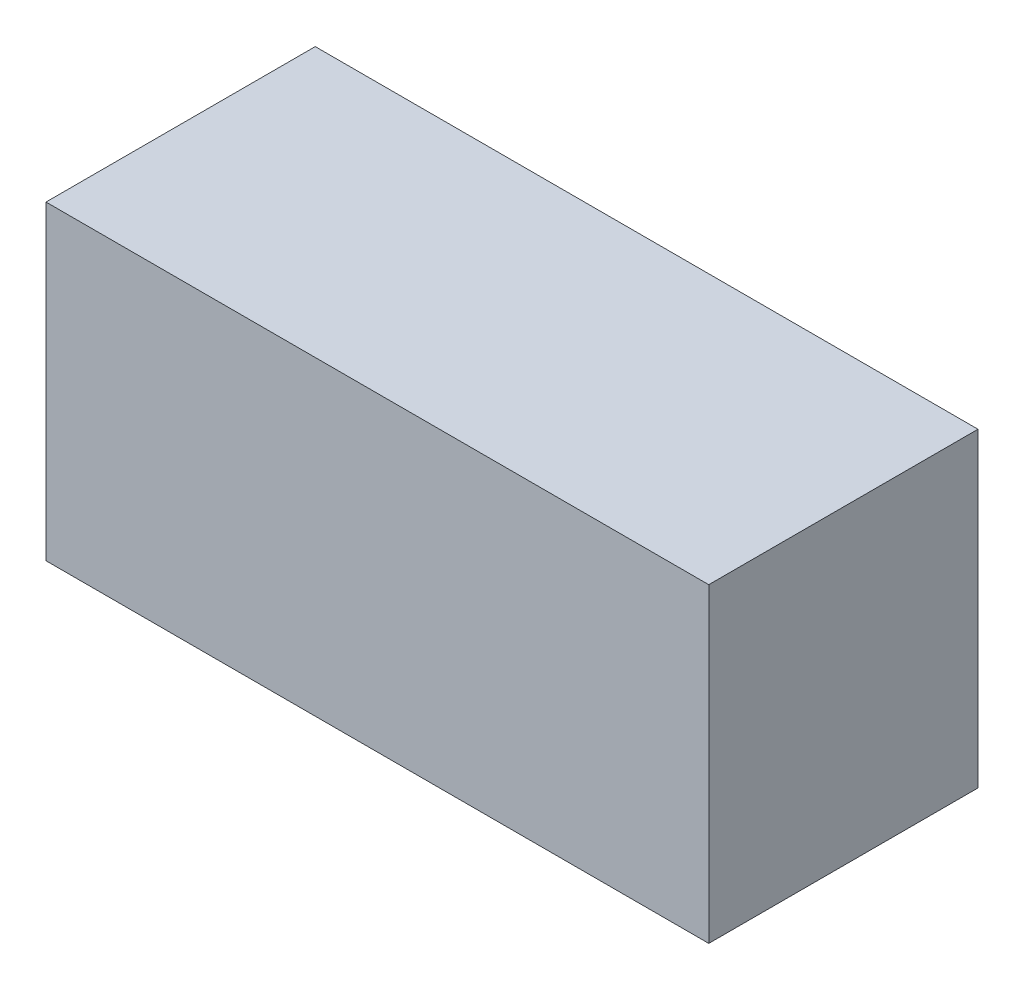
ISO-10303-21;
HEADER;
FILE_DESCRIPTION(('STEP AP214'),'2;1');
FILE_NAME('part.step','',(''),(''),'','','');
FILE_SCHEMA(('AUTOMOTIVE_DESIGN { 1 0 10303 214 1 1 1 1 }'));
ENDSEC;
DATA;
#1=APPLICATION_CONTEXT('core data for automotive mechanical design processes');
#2=APPLICATION_PROTOCOL_DEFINITION('international standard','automotive_design',2000,#1);
#3=PRODUCT_CONTEXT('',#1,'mechanical');
#4=PRODUCT('Part','Part','',(#3));
#5=PRODUCT_RELATED_PRODUCT_CATEGORY('part','',(#4));
#6=PRODUCT_DEFINITION_FORMATION('','',#4);
#7=PRODUCT_DEFINITION_CONTEXT('part definition',#1,'design');
#8=PRODUCT_DEFINITION('design','',#6,#7);
#9=PRODUCT_DEFINITION_SHAPE('','',#8);
#10=(LENGTH_UNIT() NAMED_UNIT(*) SI_UNIT(.MILLI.,.METRE.));
#11=(NAMED_UNIT(*) PLANE_ANGLE_UNIT() SI_UNIT($,.RADIAN.));
#12=(NAMED_UNIT(*) SI_UNIT($,.STERADIAN.) SOLID_ANGLE_UNIT());
#13=UNCERTAINTY_MEASURE_WITH_UNIT(LENGTH_MEASURE(1.E-05),#10,'distance_accuracy_value','');
#14=(GEOMETRIC_REPRESENTATION_CONTEXT(3) GLOBAL_UNCERTAINTY_ASSIGNED_CONTEXT((#13)) GLOBAL_UNIT_ASSIGNED_CONTEXT((#10,
#11,#12)) REPRESENTATION_CONTEXT('',''));
#15=CARTESIAN_POINT('',(0.,0.,0.));
#16=DIRECTION('',(0.,0.,1.));
#17=DIRECTION('',(1.,0.,0.));
#18=AXIS2_PLACEMENT_3D('',#15,#16,#17);
#19=CARTESIAN_POINT('',(-1.59999934,0.75000104,1.29999994));
#20=DIRECTION('',(0.,0.,1.));
#21=DIRECTION('',(1.,0.,0.));
#22=AXIS2_PLACEMENT_3D('',#19,#20,#21);
#23=PLANE('',#22);
#24=DIRECTION('',(0.,1.,0.));
#25=VECTOR('',#24,1.);
#26=CARTESIAN_POINT('',(1.59999934,0.75000104,1.29999994));
#27=LINE('',#26,#25);
#28=CARTESIAN_POINT('',(1.59999934,0.75000104,1.29999994));
#29=VERTEX_POINT('',#28);
#30=CARTESIAN_POINT('',(1.59999934,-0.7499985,1.29999994));
#31=VERTEX_POINT('',#30);
#32=EDGE_CURVE('E53',#29,#31,#27,.F.);
#33=ORIENTED_EDGE('',*,*,#32,.F.);
#34=DIRECTION('',(1.,0.,0.));
#35=VECTOR('',#34,1.);
#36=CARTESIAN_POINT('',(-1.59999934,0.75000104,1.29999994));
#37=LINE('',#36,#35);
#38=CARTESIAN_POINT('',(-1.59999934,0.75000104,1.29999994));
#39=VERTEX_POINT('',#38);
#40=EDGE_CURVE('E68',#39,#29,#37,.T.);
#41=ORIENTED_EDGE('',*,*,#40,.F.);
#42=DIRECTION('',(0.,1.,0.));
#43=VECTOR('',#42,1.);
#44=CARTESIAN_POINT('',(-1.59999934,-0.7499985,1.29999994));
#45=LINE('',#44,#43);
#46=CARTESIAN_POINT('',(-1.59999934,-0.7499985,1.29999994));
#47=VERTEX_POINT('',#46);
#48=EDGE_CURVE('E20',#47,#39,#45,.T.);
#49=ORIENTED_EDGE('',*,*,#48,.F.);
#50=DIRECTION('',(1.,0.,0.));
#51=VECTOR('',#50,1.);
#52=CARTESIAN_POINT('',(1.59999934,-0.7499985,1.29999994));
#53=LINE('',#52,#51);
#54=EDGE_CURVE('E58',#31,#47,#53,.F.);
#55=ORIENTED_EDGE('',*,*,#54,.F.);
#56=EDGE_LOOP('',(#33,#41,#49,#55));
#57=FACE_BOUND('',#56,.T.);
#58=ADVANCED_FACE('F17',(#57),#23,.T.);
#59=CARTESIAN_POINT('',(-1.59999934,-0.7499985,0.));
#60=DIRECTION('',(-1.,0.,0.));
#61=DIRECTION('',(0.,0.,1.));
#62=AXIS2_PLACEMENT_3D('',#59,#60,#61);
#63=PLANE('',#62);
#64=DIRECTION('',(0.,0.,1.));
#65=VECTOR('',#64,1.);
#66=CARTESIAN_POINT('',(-1.59999934,0.75000104,0.));
#67=LINE('',#66,#65);
#68=CARTESIAN_POINT('',(-1.59999934,0.75000104,0.));
#69=VERTEX_POINT('',#68);
#70=EDGE_CURVE('E79',#69,#39,#67,.T.);
#71=ORIENTED_EDGE('',*,*,#70,.F.);
#72=DIRECTION('',(0.,1.,0.));
#73=VECTOR('',#72,1.);
#74=CARTESIAN_POINT('',(-1.59999934,0.75000104,0.));
#75=LINE('',#74,#73);
#76=CARTESIAN_POINT('',(-1.59999934,-0.7499985,0.));
#77=VERTEX_POINT('',#76);
#78=EDGE_CURVE('E74',#69,#77,#75,.F.);
#79=ORIENTED_EDGE('',*,*,#78,.T.);
#80=DIRECTION('',(0.,0.,-1.));
#81=VECTOR('',#80,1.);
#82=CARTESIAN_POINT('',(-1.59999934,-0.7499985,0.));
#83=LINE('',#82,#81);
#84=EDGE_CURVE('E63',#47,#77,#83,.T.);
#85=ORIENTED_EDGE('',*,*,#84,.F.);
#86=ORIENTED_EDGE('',*,*,#48,.T.);
#87=EDGE_LOOP('',(#71,#79,#85,#86));
#88=FACE_BOUND('',#87,.T.);
#89=ADVANCED_FACE('F73',(#88),#63,.T.);
#90=CARTESIAN_POINT('',(1.59999934,-0.7499985,0.));
#91=DIRECTION('',(0.,-1.,0.));
#92=DIRECTION('',(0.,0.,-1.));
#93=AXIS2_PLACEMENT_3D('',#90,#91,#92);
#94=PLANE('',#93);
#95=ORIENTED_EDGE('',*,*,#84,.T.);
#96=DIRECTION('',(1.,0.,0.));
#97=VECTOR('',#96,1.);
#98=CARTESIAN_POINT('',(-1.59999934,-0.7499985,0.));
#99=LINE('',#98,#97);
#100=CARTESIAN_POINT('',(1.59999934,-0.7499985,0.));
#101=VERTEX_POINT('',#100);
#102=EDGE_CURVE('E84',#77,#101,#99,.T.);
#103=ORIENTED_EDGE('',*,*,#102,.T.);
#104=DIRECTION('',(0.,0.,-1.));
#105=VECTOR('',#104,1.);
#106=CARTESIAN_POINT('',(1.59999934,-0.7499985,0.));
#107=LINE('',#106,#105);
#108=EDGE_CURVE('E65',#31,#101,#107,.T.);
#109=ORIENTED_EDGE('',*,*,#108,.F.);
#110=ORIENTED_EDGE('',*,*,#54,.T.);
#111=EDGE_LOOP('',(#95,#103,#109,#110));
#112=FACE_BOUND('',#111,.T.);
#113=ADVANCED_FACE('F60',(#112),#94,.T.);
#114=CARTESIAN_POINT('',(1.59999934,0.75000104,0.));
#115=DIRECTION('',(1.,0.,0.));
#116=DIRECTION('',(0.,0.,-1.));
#117=AXIS2_PLACEMENT_3D('',#114,#115,#116);
#118=PLANE('',#117);
#119=ORIENTED_EDGE('',*,*,#108,.T.);
#120=DIRECTION('',(0.,1.,0.));
#121=VECTOR('',#120,1.);
#122=CARTESIAN_POINT('',(1.59999934,0.75000104,0.));
#123=LINE('',#122,#121);
#124=CARTESIAN_POINT('',(1.59999934,0.75000104,0.));
#125=VERTEX_POINT('',#124);
#126=EDGE_CURVE('E26',#101,#125,#123,.T.);
#127=ORIENTED_EDGE('',*,*,#126,.T.);
#128=DIRECTION('',(0.,0.,1.));
#129=VECTOR('',#128,1.);
#130=CARTESIAN_POINT('',(1.59999934,0.75000104,0.));
#131=LINE('',#130,#129);
#132=EDGE_CURVE('E34',#29,#125,#131,.F.);
#133=ORIENTED_EDGE('',*,*,#132,.F.);
#134=ORIENTED_EDGE('',*,*,#32,.T.);
#135=EDGE_LOOP('',(#119,#127,#133,#134));
#136=FACE_BOUND('',#135,.T.);
#137=ADVANCED_FACE('F88',(#136),#118,.T.);
#138=CARTESIAN_POINT('',(-1.59999934,0.75000104,0.));
#139=DIRECTION('',(0.,1.,0.));
#140=DIRECTION('',(0.,0.,1.));
#141=AXIS2_PLACEMENT_3D('',#138,#139,#140);
#142=PLANE('',#141);
#143=ORIENTED_EDGE('',*,*,#132,.T.);
#144=DIRECTION('',(1.,0.,0.));
#145=VECTOR('',#144,1.);
#146=CARTESIAN_POINT('',(-1.59999934,0.75000104,0.));
#147=LINE('',#146,#145);
#148=EDGE_CURVE('E11',#125,#69,#147,.F.);
#149=ORIENTED_EDGE('',*,*,#148,.T.);
#150=ORIENTED_EDGE('',*,*,#70,.T.);
#151=ORIENTED_EDGE('',*,*,#40,.T.);
#152=EDGE_LOOP('',(#143,#149,#150,#151));
#153=FACE_BOUND('',#152,.T.);
#154=ADVANCED_FACE('F91',(#153),#142,.T.);
#155=CARTESIAN_POINT('',(-1.59999934,0.75000104,0.));
#156=DIRECTION('',(0.,0.,1.));
#157=DIRECTION('',(1.,0.,0.));
#158=AXIS2_PLACEMENT_3D('',#155,#156,#157);
#159=PLANE('',#158);
#160=ORIENTED_EDGE('',*,*,#126,.F.);
#161=ORIENTED_EDGE('',*,*,#102,.F.);
#162=ORIENTED_EDGE('',*,*,#78,.F.);
#163=ORIENTED_EDGE('',*,*,#148,.F.);
#164=EDGE_LOOP('',(#160,#161,#162,#163));
#165=FACE_BOUND('',#164,.T.);
#166=ADVANCED_FACE('F90',(#165),#159,.F.);
#167=CLOSED_SHELL('',(#58,#89,#113,#137,#154,#166));
#168=MANIFOLD_SOLID_BREP('B1',#167);
#169=ADVANCED_BREP_SHAPE_REPRESENTATION('',(#18,#168),#14);
#170=SHAPE_DEFINITION_REPRESENTATION(#9,#169);
ENDSEC;
END-ISO-10303-21;
